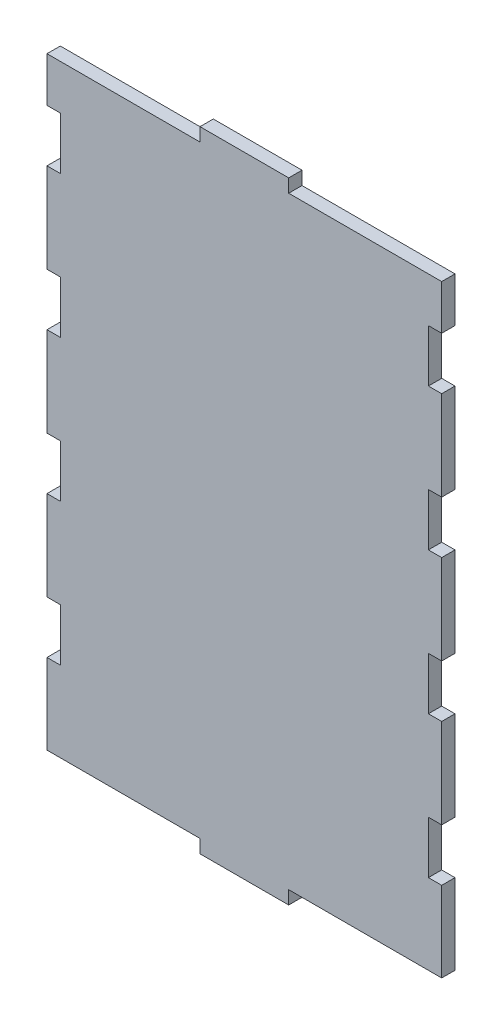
from build123d import *

# Parameters (mm, degrees)
CROQUIS1_W              = 445
CROQUIS1_H              = 710
SALIENTE_EXTRUIR1_DEPTH = 15
CROQUIS2_W              = 172.5
CROQUIS2_H              = 15
CORTAR_EXTRUIR1_DEPTH   = 420.232930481
CROQUIS4_W              = 15
CROQUIS4_H              = 59
CORTAR_EXTRUIR2_DEPTH   = 15


with BuildPart() as part:
    # Croquis1 → Saliente-Extruir1 (new body)
    with BuildSketch(Plane.XY):
        Rectangle(CROQUIS1_W, CROQUIS1_H)
    extrude(amount=SALIENTE_EXTRUIR1_DEPTH)

    # Croquis2 → Cortar-Extruir1 (cut, through all)
    with BuildSketch(Plane.XY.offset(15)):
        with Locations((-136.25, -347.5)):
            Rectangle(CROQUIS2_W, CROQUIS2_H)
        with Locations((136.25, -347.5)):
            Rectangle(CROQUIS2_W, CROQUIS2_H)
        with Locations((136.25, 347.5)):
            Rectangle(CROQUIS2_W, CROQUIS2_H)
        with Locations((-136.25, 347.5)):
            Rectangle(CROQUIS2_W, CROQUIS2_H)
    extrude(amount=-CORTAR_EXTRUIR1_DEPTH, mode=Mode.SUBTRACT)

    # Croquis4 → Cortar-Extruir2 (cut)
    with BuildSketch(Plane.XY.offset(15)):
        with Locations((-215, 100)):
            Rectangle(CROQUIS4_W, CROQUIS4_H)
        with Locations((-215, -60)):
            Rectangle(CROQUIS4_W, CROQUIS4_H)
        with Locations((-215, -220)):
            Rectangle(CROQUIS4_W, CROQUIS4_H)
        with Locations((215, -220)):
            Rectangle(CROQUIS4_W, CROQUIS4_H)
        with Locations((215, -60)):
            Rectangle(CROQUIS4_W, CROQUIS4_H)
        with Locations((215, 100)):
            Rectangle(CROQUIS4_W, CROQUIS4_H)
        with Locations((215, 260)):
            Rectangle(CROQUIS4_W, CROQUIS4_H)
        with Locations((-215, 260)):
            Rectangle(CROQUIS4_W, CROQUIS4_H)
    extrude(amount=-CORTAR_EXTRUIR2_DEPTH, mode=Mode.SUBTRACT)


solid = part.part
